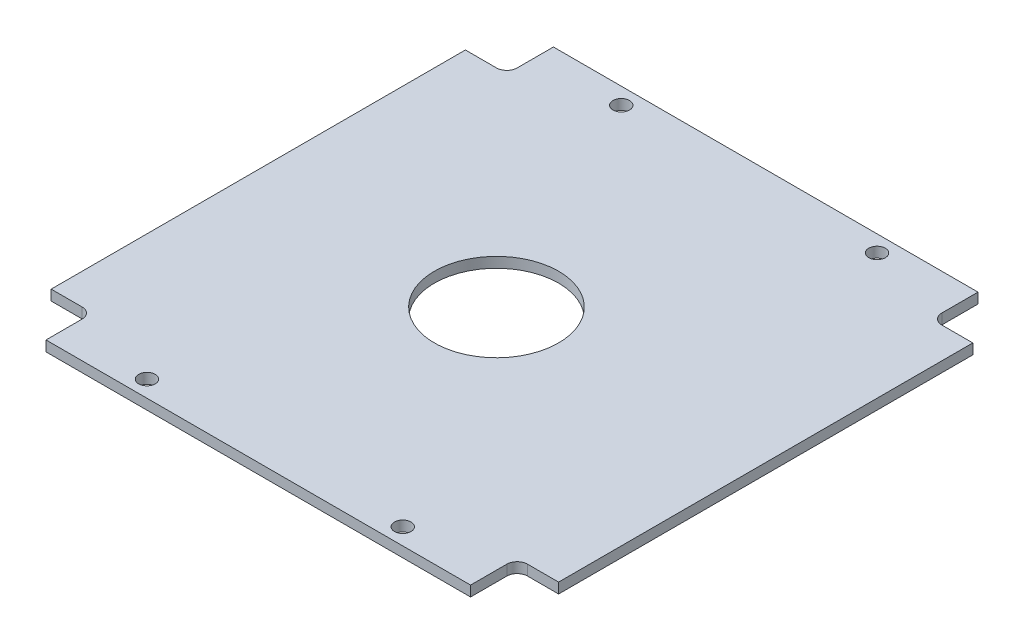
from build123d import *

# Parameters (mm, degrees)
BOSS_EXTRUDE1_DEPTH        = 2
F_3_2_3_2_DIAMETER_HOLE1_D = 3.2
SKETCH4_R                  = 12
CUT_EXTRUDE1_DEPTH         = 10


with BuildPart() as part:
    # Sketch1 → Boss-Extrude1 (new body)
    with BuildSketch(Plane(origin=(0, 0, 0), x_dir=(1, 0, 0), z_dir=(0, 1, 0))):
        with BuildLine():
            Line((-49, 40), (-49, -40))
            Line((-49, -40), (-43, -40))
            ThreePointArc((-43, -40), (-41.585786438, -40.585786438), (-41, -42))
            Line((-41, -42), (-41, -49))
            Line((-41, -49), (41, -49))
            Line((41, -49), (41, -42))
            ThreePointArc((41, -42), (41.585786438, -40.585786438), (43, -40))
            Line((43, -40), (49, -40))
            Line((49, -40), (49, 40))
            Line((49, 40), (43, 40))
            ThreePointArc((43, 40), (41.585786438, 40.585786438), (41, 42))
            Line((41, 42), (41, 49))
            Line((41, 49), (-41, 49))
            Line((-41, 49), (-41, 42))
            ThreePointArc((-41, 42), (-41.585786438, 40.585786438), (-43, 40))
            Line((-43, 40), (-49, 40))
        make_face()
    extrude(amount=BOSS_EXTRUDE1_DEPTH)

    # 3.2 _3.2_ Diameter Hole1 (through all)
    with Locations(Plane(origin=(0, 2, 0), x_dir=(1, 0, 0), z_dir=(0, 1, 0))):
        with Locations((24.7, 45.8), (-24.7, 45.8), (-24.7, -45.8), (24.7, -45.8)):
            Hole(F_3_2_3_2_DIAMETER_HOLE1_D / 2)

    # Sketch4 → Cut-Extrude1 (cut)
    with BuildSketch(Plane.XZ):
        with Locations(Location((-3, 0, 0), (0, 0, 270))):
            Circle(SKETCH4_R)
    extrude(amount=-CUT_EXTRUDE1_DEPTH, mode=Mode.SUBTRACT)


solid = part.part
